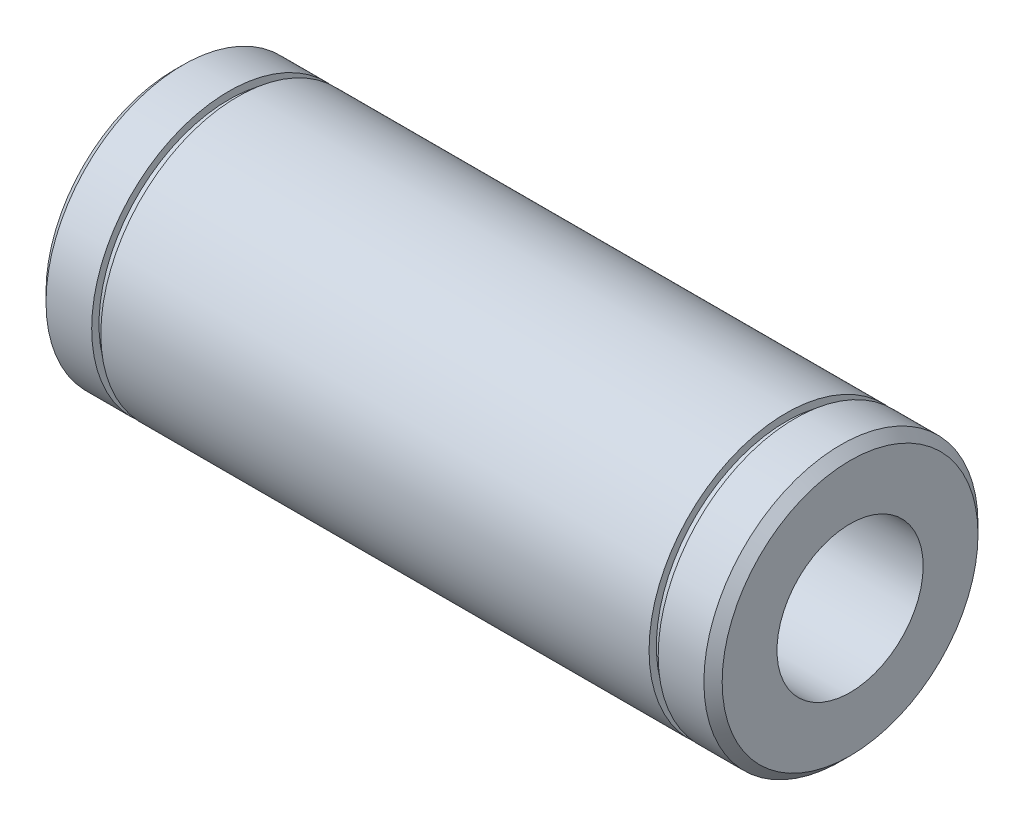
ISO-10303-21;
HEADER;
FILE_DESCRIPTION(('STEP AP214'),'2;1');
FILE_NAME('part.step','',(''),(''),'','','');
FILE_SCHEMA(('AUTOMOTIVE_DESIGN { 1 0 10303 214 1 1 1 1 }'));
ENDSEC;
DATA;
#1=APPLICATION_CONTEXT('core data for automotive mechanical design processes');
#2=APPLICATION_PROTOCOL_DEFINITION('international standard','automotive_design',2000,#1);
#3=PRODUCT_CONTEXT('',#1,'mechanical');
#4=PRODUCT('Part','Part','',(#3));
#5=PRODUCT_RELATED_PRODUCT_CATEGORY('part','',(#4));
#6=PRODUCT_DEFINITION_FORMATION('','',#4);
#7=PRODUCT_DEFINITION_CONTEXT('part definition',#1,'design');
#8=PRODUCT_DEFINITION('design','',#6,#7);
#9=PRODUCT_DEFINITION_SHAPE('','',#8);
#10=(LENGTH_UNIT() NAMED_UNIT(*) SI_UNIT(.MILLI.,.METRE.));
#11=(NAMED_UNIT(*) PLANE_ANGLE_UNIT() SI_UNIT($,.RADIAN.));
#12=(NAMED_UNIT(*) SI_UNIT($,.STERADIAN.) SOLID_ANGLE_UNIT());
#13=UNCERTAINTY_MEASURE_WITH_UNIT(LENGTH_MEASURE(1.E-05),#10,'distance_accuracy_value','');
#14=(GEOMETRIC_REPRESENTATION_CONTEXT(3) GLOBAL_UNCERTAINTY_ASSIGNED_CONTEXT((#13)) GLOBAL_UNIT_ASSIGNED_CONTEXT((#10,
#11,#12)) REPRESENTATION_CONTEXT('',''));
#15=CARTESIAN_POINT('',(0.,0.,0.));
#16=DIRECTION('',(0.,0.,1.));
#17=DIRECTION('',(1.,0.,0.));
#18=AXIS2_PLACEMENT_3D('',#15,#16,#17);
#19=CARTESIAN_POINT('',(-20.35,0.,0.));
#20=DIRECTION('',(1.,0.,0.));
#21=DIRECTION('',(0.,0.,-1.));
#22=AXIS2_PLACEMENT_3D('',#19,#20,#21);
#23=CYLINDRICAL_SURFACE('',#22,4.);
#24=CARTESIAN_POINT('',(18.5,0.,0.));
#25=DIRECTION('',(1.,0.,0.));
#26=DIRECTION('',(0.,0.,-1.));
#27=AXIS2_PLACEMENT_3D('',#24,#25,#26);
#28=CIRCLE('',#27,4.);
#29=CARTESIAN_POINT('',(18.5,0.,-4.));
#30=VERTEX_POINT('',#29);
#31=EDGE_CURVE('E67',#30,#30,#28,.F.);
#32=ORIENTED_EDGE('',*,*,#31,.F.);
#33=EDGE_LOOP('',(#32));
#34=FACE_BOUND('',#33,.T.);
#35=CARTESIAN_POINT('',(-18.5,0.,0.));
#36=DIRECTION('',(1.,0.,0.));
#37=DIRECTION('',(0.,0.,-1.));
#38=AXIS2_PLACEMENT_3D('',#35,#36,#37);
#39=CIRCLE('',#38,4.);
#40=CARTESIAN_POINT('',(-18.5,0.,-4.));
#41=VERTEX_POINT('',#40);
#42=EDGE_CURVE('E18',#41,#41,#39,.F.);
#43=ORIENTED_EDGE('',*,*,#42,.T.);
#44=EDGE_LOOP('',(#43));
#45=FACE_BOUND('',#44,.T.);
#46=ADVANCED_FACE('F15',(#34,#45),#23,.F.);
#47=CARTESIAN_POINT('',(-18.5,0.,0.));
#48=DIRECTION('',(1.,0.,0.));
#49=DIRECTION('',(0.,0.,-1.));
#50=AXIS2_PLACEMENT_3D('',#47,#48,#49);
#51=PLANE('',#50);
#52=ORIENTED_EDGE('',*,*,#42,.F.);
#53=EDGE_LOOP('',(#52));
#54=FACE_BOUND('',#53,.T.);
#55=CARTESIAN_POINT('',(-18.5,0.,0.));
#56=DIRECTION('',(1.,0.,0.));
#57=DIRECTION('',(0.,0.,-1.));
#58=AXIS2_PLACEMENT_3D('',#55,#56,#57);
#59=CIRCLE('',#58,7.00000000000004);
#60=CARTESIAN_POINT('',(-18.5,0.,-7.00000000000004));
#61=VERTEX_POINT('',#60);
#62=EDGE_CURVE('E64',#61,#61,#59,.T.);
#63=ORIENTED_EDGE('',*,*,#62,.F.);
#64=EDGE_LOOP('',(#63));
#65=FACE_BOUND('',#64,.T.);
#66=ADVANCED_FACE('F77',(#54,#65),#51,.F.);
#67=CARTESIAN_POINT('',(18.5,0.,0.));
#68=DIRECTION('',(1.,0.,0.));
#69=DIRECTION('',(0.,0.,-1.));
#70=AXIS2_PLACEMENT_3D('',#67,#68,#69);
#71=PLANE('',#70);
#72=ORIENTED_EDGE('',*,*,#31,.T.);
#73=EDGE_LOOP('',(#72));
#74=FACE_BOUND('',#73,.T.);
#75=CARTESIAN_POINT('',(18.5,0.,0.));
#76=DIRECTION('',(-1.,0.,0.));
#77=DIRECTION('',(0.,0.,1.));
#78=AXIS2_PLACEMENT_3D('',#75,#76,#77);
#79=CIRCLE('',#78,7.00000000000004);
#80=CARTESIAN_POINT('',(18.5,0.,7.00000000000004));
#81=VERTEX_POINT('',#80);
#82=EDGE_CURVE('E60',#81,#81,#79,.T.);
#83=ORIENTED_EDGE('',*,*,#82,.F.);
#84=EDGE_LOOP('',(#83));
#85=FACE_BOUND('',#84,.T.);
#86=ADVANCED_FACE('F80',(#74,#85),#71,.T.);
#87=CARTESIAN_POINT('',(-18.,0.,0.));
#88=DIRECTION('',(1.,0.,0.));
#89=DIRECTION('',(0.,0.,-1.));
#90=AXIS2_PLACEMENT_3D('',#87,#88,#89);
#91=CONICAL_SURFACE('',#90,7.49999999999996,0.785398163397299);
#92=CARTESIAN_POINT('',(-18.,0.,0.));
#93=DIRECTION('',(1.,0.,0.));
#94=DIRECTION('',(0.,0.,-1.));
#95=AXIS2_PLACEMENT_3D('',#92,#93,#94);
#96=CIRCLE('',#95,7.5);
#97=CARTESIAN_POINT('',(-18.,0.,-7.5));
#98=VERTEX_POINT('',#97);
#99=EDGE_CURVE('E34',#98,#98,#96,.T.);
#100=ORIENTED_EDGE('',*,*,#99,.F.);
#101=EDGE_LOOP('',(#100));
#102=FACE_BOUND('',#101,.T.);
#103=ORIENTED_EDGE('',*,*,#62,.T.);
#104=EDGE_LOOP('',(#103));
#105=FACE_BOUND('',#104,.T.);
#106=ADVANCED_FACE('F83',(#102,#105),#91,.T.);
#107=CARTESIAN_POINT('',(18.,0.,0.));
#108=DIRECTION('',(-1.,0.,0.));
#109=DIRECTION('',(0.,0.,1.));
#110=AXIS2_PLACEMENT_3D('',#107,#108,#109);
#111=CONICAL_SURFACE('',#110,7.49999999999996,0.785398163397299);
#112=ORIENTED_EDGE('',*,*,#82,.T.);
#113=EDGE_LOOP('',(#112));
#114=FACE_BOUND('',#113,.T.);
#115=CARTESIAN_POINT('',(18.,0.,0.));
#116=DIRECTION('',(1.,0.,0.));
#117=DIRECTION('',(0.,0.,-1.));
#118=AXIS2_PLACEMENT_3D('',#115,#116,#117);
#119=CIRCLE('',#118,7.5);
#120=CARTESIAN_POINT('',(18.,0.,-7.5));
#121=VERTEX_POINT('',#120);
#122=EDGE_CURVE('E59',#121,#121,#119,.F.);
#123=ORIENTED_EDGE('',*,*,#122,.F.);
#124=EDGE_LOOP('',(#123));
#125=FACE_BOUND('',#124,.T.);
#126=ADVANCED_FACE('F85',(#114,#125),#111,.T.);
#127=CARTESIAN_POINT('',(-20.35,0.,0.));
#128=DIRECTION('',(1.,0.,0.));
#129=DIRECTION('',(0.,0.,-1.));
#130=AXIS2_PLACEMENT_3D('',#127,#128,#129);
#131=CYLINDRICAL_SURFACE('',#130,7.5);
#132=CARTESIAN_POINT('',(-15.5,0.,0.));
#133=DIRECTION('',(1.,0.,0.));
#134=DIRECTION('',(0.,0.,-1.));
#135=AXIS2_PLACEMENT_3D('',#132,#133,#134);
#136=CIRCLE('',#135,7.5);
#137=CARTESIAN_POINT('',(-15.5,0.,-7.5));
#138=VERTEX_POINT('',#137);
#139=EDGE_CURVE('E55',#138,#138,#136,.T.);
#140=ORIENTED_EDGE('',*,*,#139,.F.);
#141=EDGE_LOOP('',(#140));
#142=FACE_BOUND('',#141,.T.);
#143=ORIENTED_EDGE('',*,*,#99,.T.);
#144=EDGE_LOOP('',(#143));
#145=FACE_BOUND('',#144,.T.);
#146=ADVANCED_FACE('F93',(#142,#145),#131,.T.);
#147=CARTESIAN_POINT('',(-20.35,0.,0.));
#148=DIRECTION('',(1.,0.,0.));
#149=DIRECTION('',(0.,0.,-1.));
#150=AXIS2_PLACEMENT_3D('',#147,#148,#149);
#151=CYLINDRICAL_SURFACE('',#150,7.5);
#152=ORIENTED_EDGE('',*,*,#122,.T.);
#153=EDGE_LOOP('',(#152));
#154=FACE_BOUND('',#153,.T.);
#155=CARTESIAN_POINT('',(15.5,0.,0.));
#156=DIRECTION('',(1.,0.,0.));
#157=DIRECTION('',(0.,0.,-1.));
#158=AXIS2_PLACEMENT_3D('',#155,#156,#157);
#159=CIRCLE('',#158,7.5);
#160=CARTESIAN_POINT('',(15.5,0.,-7.5));
#161=VERTEX_POINT('',#160);
#162=EDGE_CURVE('E51',#161,#161,#159,.T.);
#163=ORIENTED_EDGE('',*,*,#162,.T.);
#164=EDGE_LOOP('',(#163));
#165=FACE_BOUND('',#164,.T.);
#166=ADVANCED_FACE('F130',(#154,#165),#151,.T.);
#167=CARTESIAN_POINT('',(-15.5,0.,0.));
#168=DIRECTION('',(1.,0.,0.));
#169=DIRECTION('',(0.,0.,-1.));
#170=AXIS2_PLACEMENT_3D('',#167,#168,#169);
#171=PLANE('',#170);
#172=CARTESIAN_POINT('',(-15.5,0.,0.));
#173=DIRECTION('',(1.,0.,0.));
#174=DIRECTION('',(0.,0.,-1.));
#175=AXIS2_PLACEMENT_3D('',#172,#173,#174);
#176=CIRCLE('',#175,7.1);
#177=CARTESIAN_POINT('',(-15.5,0.,-7.1));
#178=VERTEX_POINT('',#177);
#179=EDGE_CURVE('E47',#178,#178,#176,.T.);
#180=ORIENTED_EDGE('',*,*,#179,.F.);
#181=EDGE_LOOP('',(#180));
#182=FACE_BOUND('',#181,.T.);
#183=ORIENTED_EDGE('',*,*,#139,.T.);
#184=EDGE_LOOP('',(#183));
#185=FACE_BOUND('',#184,.T.);
#186=ADVANCED_FACE('F126',(#182,#185),#171,.T.);
#187=CARTESIAN_POINT('',(15.5,0.,0.));
#188=DIRECTION('',(1.,0.,0.));
#189=DIRECTION('',(0.,0.,-1.));
#190=AXIS2_PLACEMENT_3D('',#187,#188,#189);
#191=PLANE('',#190);
#192=CARTESIAN_POINT('',(15.5,0.,0.));
#193=DIRECTION('',(1.,0.,0.));
#194=DIRECTION('',(0.,0.,-1.));
#195=AXIS2_PLACEMENT_3D('',#192,#193,#194);
#196=CIRCLE('',#195,7.1);
#197=CARTESIAN_POINT('',(15.5,0.,-7.1));
#198=VERTEX_POINT('',#197);
#199=EDGE_CURVE('E43',#198,#198,#196,.F.);
#200=ORIENTED_EDGE('',*,*,#199,.F.);
#201=EDGE_LOOP('',(#200));
#202=FACE_BOUND('',#201,.T.);
#203=ORIENTED_EDGE('',*,*,#162,.F.);
#204=EDGE_LOOP('',(#203));
#205=FACE_BOUND('',#204,.T.);
#206=ADVANCED_FACE('F122',(#202,#205),#191,.F.);
#207=CARTESIAN_POINT('',(-20.35,0.,0.));
#208=DIRECTION('',(1.,0.,0.));
#209=DIRECTION('',(0.,0.,-1.));
#210=AXIS2_PLACEMENT_3D('',#207,#208,#209);
#211=CYLINDRICAL_SURFACE('',#210,7.1);
#212=ORIENTED_EDGE('',*,*,#179,.T.);
#213=EDGE_LOOP('',(#212));
#214=FACE_BOUND('',#213,.T.);
#215=CARTESIAN_POINT('',(-15.,0.,0.));
#216=DIRECTION('',(1.,0.,0.));
#217=DIRECTION('',(0.,0.,-1.));
#218=AXIS2_PLACEMENT_3D('',#215,#216,#217);
#219=CIRCLE('',#218,7.1);
#220=CARTESIAN_POINT('',(-15.,0.,-7.1));
#221=VERTEX_POINT('',#220);
#222=EDGE_CURVE('E39',#221,#221,#219,.F.);
#223=ORIENTED_EDGE('',*,*,#222,.T.);
#224=EDGE_LOOP('',(#223));
#225=FACE_BOUND('',#224,.T.);
#226=ADVANCED_FACE('F118',(#214,#225),#211,.T.);
#227=CARTESIAN_POINT('',(-20.35,0.,0.));
#228=DIRECTION('',(1.,0.,0.));
#229=DIRECTION('',(0.,0.,-1.));
#230=AXIS2_PLACEMENT_3D('',#227,#228,#229);
#231=CYLINDRICAL_SURFACE('',#230,7.1);
#232=CARTESIAN_POINT('',(15.,0.,0.));
#233=DIRECTION('',(1.,0.,0.));
#234=DIRECTION('',(0.,0.,-1.));
#235=AXIS2_PLACEMENT_3D('',#232,#233,#234);
#236=CIRCLE('',#235,7.1);
#237=CARTESIAN_POINT('',(15.,0.,-7.1));
#238=VERTEX_POINT('',#237);
#239=EDGE_CURVE('E31',#238,#238,#236,.F.);
#240=ORIENTED_EDGE('',*,*,#239,.F.);
#241=EDGE_LOOP('',(#240));
#242=FACE_BOUND('',#241,.T.);
#243=ORIENTED_EDGE('',*,*,#199,.T.);
#244=EDGE_LOOP('',(#243));
#245=FACE_BOUND('',#244,.T.);
#246=ADVANCED_FACE('F114',(#242,#245),#231,.T.);
#247=CARTESIAN_POINT('',(-15.,0.,0.));
#248=DIRECTION('',(1.,0.,0.));
#249=DIRECTION('',(0.,0.,-1.));
#250=AXIS2_PLACEMENT_3D('',#247,#248,#249);
#251=PLANE('',#250);
#252=ORIENTED_EDGE('',*,*,#222,.F.);
#253=EDGE_LOOP('',(#252));
#254=FACE_BOUND('',#253,.T.);
#255=CARTESIAN_POINT('',(-15.,0.,0.));
#256=DIRECTION('',(1.,0.,0.));
#257=DIRECTION('',(0.,0.,-1.));
#258=AXIS2_PLACEMENT_3D('',#255,#256,#257);
#259=CIRCLE('',#258,7.5);
#260=CARTESIAN_POINT('',(-15.,0.,-7.5));
#261=VERTEX_POINT('',#260);
#262=EDGE_CURVE('E23',#261,#261,#259,.T.);
#263=ORIENTED_EDGE('',*,*,#262,.F.);
#264=EDGE_LOOP('',(#263));
#265=FACE_BOUND('',#264,.T.);
#266=ADVANCED_FACE('F107',(#254,#265),#251,.F.);
#267=CARTESIAN_POINT('',(15.,0.,0.));
#268=DIRECTION('',(1.,0.,0.));
#269=DIRECTION('',(0.,0.,-1.));
#270=AXIS2_PLACEMENT_3D('',#267,#268,#269);
#271=PLANE('',#270);
#272=ORIENTED_EDGE('',*,*,#239,.T.);
#273=EDGE_LOOP('',(#272));
#274=FACE_BOUND('',#273,.T.);
#275=CARTESIAN_POINT('',(15.,0.,0.));
#276=DIRECTION('',(1.,0.,0.));
#277=DIRECTION('',(0.,0.,-1.));
#278=AXIS2_PLACEMENT_3D('',#275,#276,#277);
#279=CIRCLE('',#278,7.5);
#280=CARTESIAN_POINT('',(15.,0.,-7.5));
#281=VERTEX_POINT('',#280);
#282=EDGE_CURVE('E10',#281,#281,#279,.F.);
#283=ORIENTED_EDGE('',*,*,#282,.F.);
#284=EDGE_LOOP('',(#283));
#285=FACE_BOUND('',#284,.T.);
#286=ADVANCED_FACE('F101',(#274,#285),#271,.T.);
#287=CARTESIAN_POINT('',(-20.35,0.,0.));
#288=DIRECTION('',(1.,0.,0.));
#289=DIRECTION('',(0.,0.,-1.));
#290=AXIS2_PLACEMENT_3D('',#287,#288,#289);
#291=CYLINDRICAL_SURFACE('',#290,7.5);
#292=ORIENTED_EDGE('',*,*,#282,.T.);
#293=EDGE_LOOP('',(#292));
#294=FACE_BOUND('',#293,.T.);
#295=ORIENTED_EDGE('',*,*,#262,.T.);
#296=EDGE_LOOP('',(#295));
#297=FACE_BOUND('',#296,.T.);
#298=ADVANCED_FACE('F99',(#294,#297),#291,.T.);
#299=CLOSED_SHELL('',(#46,#66,#86,#106,#126,#146,#166,#186,#206,#226,#246,#266,#286,#298));
#300=MANIFOLD_SOLID_BREP('B1',#299);
#301=ADVANCED_BREP_SHAPE_REPRESENTATION('',(#18,#300),#14);
#302=SHAPE_DEFINITION_REPRESENTATION(#9,#301);
ENDSEC;
END-ISO-10303-21;
